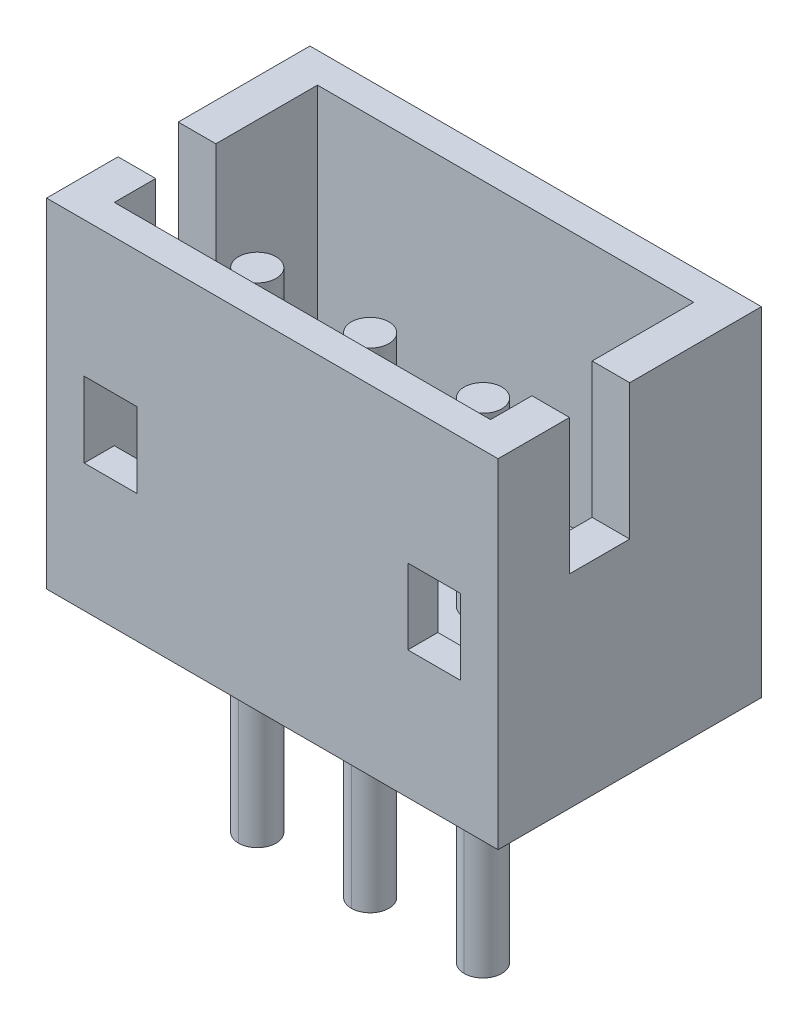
ISO-10303-21;
HEADER;
FILE_DESCRIPTION(('STEP AP214'),'2;1');
FILE_NAME('part.step','',(''),(''),'','','');
FILE_SCHEMA(('AUTOMOTIVE_DESIGN { 1 0 10303 214 1 1 1 1 }'));
ENDSEC;
DATA;
#1=APPLICATION_CONTEXT('core data for automotive mechanical design processes');
#2=APPLICATION_PROTOCOL_DEFINITION('international standard','automotive_design',2000,#1);
#3=PRODUCT_CONTEXT('',#1,'mechanical');
#4=PRODUCT('Part','Part','',(#3));
#5=PRODUCT_RELATED_PRODUCT_CATEGORY('part','',(#4));
#6=PRODUCT_DEFINITION_FORMATION('','',#4);
#7=PRODUCT_DEFINITION_CONTEXT('part definition',#1,'design');
#8=PRODUCT_DEFINITION('design','',#6,#7);
#9=PRODUCT_DEFINITION_SHAPE('','',#8);
#10=(LENGTH_UNIT() NAMED_UNIT(*) SI_UNIT(.MILLI.,.METRE.));
#11=(NAMED_UNIT(*) PLANE_ANGLE_UNIT() SI_UNIT($,.RADIAN.));
#12=(NAMED_UNIT(*) SI_UNIT($,.STERADIAN.) SOLID_ANGLE_UNIT());
#13=UNCERTAINTY_MEASURE_WITH_UNIT(LENGTH_MEASURE(1.E-05),#10,'distance_accuracy_value','');
#14=(GEOMETRIC_REPRESENTATION_CONTEXT(3) GLOBAL_UNCERTAINTY_ASSIGNED_CONTEXT((#13)) GLOBAL_UNIT_ASSIGNED_CONTEXT((#10,
#11,#12)) REPRESENTATION_CONTEXT('',''));
#15=CARTESIAN_POINT('',(0.,0.,0.));
#16=DIRECTION('',(0.,0.,1.));
#17=DIRECTION('',(1.,0.,0.));
#18=AXIS2_PLACEMENT_3D('',#15,#16,#17);
#19=CARTESIAN_POINT('',(1.5,3.8,-1.3));
#20=DIRECTION('',(0.,1.,0.));
#21=DIRECTION('',(1.,0.,0.));
#22=AXIS2_PLACEMENT_3D('',#19,#20,#21);
#23=PLANE('',#22);
#24=CARTESIAN_POINT('',(1.5,3.8,-1.3));
#25=DIRECTION('',(0.,1.,0.));
#26=DIRECTION('',(0.,0.,1.));
#27=AXIS2_PLACEMENT_3D('',#24,#25,#26);
#28=CIRCLE('',#27,0.25);
#29=CARTESIAN_POINT('',(1.5,3.8,-1.05));
#30=VERTEX_POINT('',#29);
#31=CARTESIAN_POINT('',(1.5,3.8,-1.55));
#32=VERTEX_POINT('',#31);
#33=EDGE_CURVE('E28',#30,#32,#28,.T.);
#34=ORIENTED_EDGE('',*,*,#33,.T.);
#35=CARTESIAN_POINT('',(1.5,3.8,-1.3));
#36=DIRECTION('',(0.,1.,0.));
#37=DIRECTION('',(0.,0.,1.));
#38=AXIS2_PLACEMENT_3D('',#35,#36,#37);
#39=CIRCLE('',#38,0.25);
#40=EDGE_CURVE('E290',#32,#30,#39,.T.);
#41=ORIENTED_EDGE('',*,*,#40,.T.);
#42=EDGE_LOOP('',(#34,#41));
#43=FACE_BOUND('',#42,.T.);
#44=ADVANCED_FACE('F18',(#43),#23,.T.);
#45=CARTESIAN_POINT('',(0.,3.8,-1.3));
#46=DIRECTION('',(0.,1.,0.));
#47=DIRECTION('',(1.,0.,0.));
#48=AXIS2_PLACEMENT_3D('',#45,#46,#47);
#49=PLANE('',#48);
#50=CARTESIAN_POINT('',(0.,3.8,-1.3));
#51=DIRECTION('',(0.,1.,0.));
#52=DIRECTION('',(0.,0.,1.));
#53=AXIS2_PLACEMENT_3D('',#50,#51,#52);
#54=CIRCLE('',#53,0.25);
#55=CARTESIAN_POINT('',(0.,3.8,-1.05));
#56=VERTEX_POINT('',#55);
#57=CARTESIAN_POINT('',(0.,3.8,-1.55));
#58=VERTEX_POINT('',#57);
#59=EDGE_CURVE('E211',#56,#58,#54,.T.);
#60=ORIENTED_EDGE('',*,*,#59,.T.);
#61=CARTESIAN_POINT('',(0.,3.8,-1.3));
#62=DIRECTION('',(0.,1.,0.));
#63=DIRECTION('',(0.,0.,1.));
#64=AXIS2_PLACEMENT_3D('',#61,#62,#63);
#65=CIRCLE('',#64,0.25);
#66=EDGE_CURVE('E223',#58,#56,#65,.T.);
#67=ORIENTED_EDGE('',*,*,#66,.T.);
#68=EDGE_LOOP('',(#60,#67));
#69=FACE_BOUND('',#68,.T.);
#70=ADVANCED_FACE('F225',(#69),#49,.T.);
#71=CARTESIAN_POINT('',(-1.5,3.8,-1.3));
#72=DIRECTION('',(0.,1.,0.));
#73=DIRECTION('',(1.,0.,0.));
#74=AXIS2_PLACEMENT_3D('',#71,#72,#73);
#75=PLANE('',#74);
#76=CARTESIAN_POINT('',(-1.5,3.8,-1.3));
#77=DIRECTION('',(0.,1.,0.));
#78=DIRECTION('',(0.,0.,1.));
#79=AXIS2_PLACEMENT_3D('',#76,#77,#78);
#80=CIRCLE('',#79,0.25);
#81=CARTESIAN_POINT('',(-1.5,3.8,-1.05));
#82=VERTEX_POINT('',#81);
#83=CARTESIAN_POINT('',(-1.5,3.8,-1.55));
#84=VERTEX_POINT('',#83);
#85=EDGE_CURVE('E11',#82,#84,#80,.T.);
#86=ORIENTED_EDGE('',*,*,#85,.T.);
#87=CARTESIAN_POINT('',(-1.5,3.8,-1.3));
#88=DIRECTION('',(0.,1.,0.));
#89=DIRECTION('',(0.,0.,1.));
#90=AXIS2_PLACEMENT_3D('',#87,#88,#89);
#91=CIRCLE('',#90,0.25);
#92=EDGE_CURVE('E238',#84,#82,#91,.T.);
#93=ORIENTED_EDGE('',*,*,#92,.T.);
#94=EDGE_LOOP('',(#86,#93));
#95=FACE_BOUND('',#94,.T.);
#96=ADVANCED_FACE('F878',(#95),#75,.T.);
#97=CARTESIAN_POINT('',(-1.5,-2.7,-1.3));
#98=DIRECTION('',(0.,1.,0.));
#99=DIRECTION('',(0.,0.,1.));
#100=AXIS2_PLACEMENT_3D('',#97,#98,#99);
#101=CYLINDRICAL_SURFACE('',#100,0.25);
#102=CARTESIAN_POINT('',(-1.5,1.4,-1.3));
#103=DIRECTION('',(0.,1.,0.));
#104=DIRECTION('',(0.,0.,1.));
#105=AXIS2_PLACEMENT_3D('',#102,#103,#104);
#106=CIRCLE('',#105,0.25);
#107=CARTESIAN_POINT('',(-1.5,1.4,-1.05));
#108=VERTEX_POINT('',#107);
#109=CARTESIAN_POINT('',(-1.5,1.4,-1.55));
#110=VERTEX_POINT('',#109);
#111=EDGE_CURVE('E264',#108,#110,#106,.T.);
#112=ORIENTED_EDGE('',*,*,#111,.T.);
#113=DIRECTION('',(0.,1.,0.));
#114=VECTOR('',#113,1.);
#115=CARTESIAN_POINT('',(-1.5,-2.7,-1.55));
#116=LINE('',#115,#114);
#117=EDGE_CURVE('E251',#110,#84,#116,.T.);
#118=ORIENTED_EDGE('',*,*,#117,.T.);
#119=ORIENTED_EDGE('',*,*,#85,.F.);
#120=DIRECTION('',(0.,1.,0.));
#121=VECTOR('',#120,1.);
#122=CARTESIAN_POINT('',(-1.5,-2.7,-1.05));
#123=LINE('',#122,#121);
#124=EDGE_CURVE('E432',#108,#82,#123,.T.);
#125=ORIENTED_EDGE('',*,*,#124,.F.);
#126=EDGE_LOOP('',(#112,#118,#119,#125));
#127=FACE_BOUND('',#126,.T.);
#128=ADVANCED_FACE('F883',(#127),#101,.T.);
#129=CARTESIAN_POINT('',(1.5,-2.7,-1.3));
#130=DIRECTION('',(0.,1.,0.));
#131=DIRECTION('',(0.,0.,1.));
#132=AXIS2_PLACEMENT_3D('',#129,#130,#131);
#133=CYLINDRICAL_SURFACE('',#132,0.25);
#134=CARTESIAN_POINT('',(1.5,1.4,-1.3));
#135=DIRECTION('',(0.,1.,0.));
#136=DIRECTION('',(0.,0.,1.));
#137=AXIS2_PLACEMENT_3D('',#134,#135,#136);
#138=CIRCLE('',#137,0.25);
#139=CARTESIAN_POINT('',(1.5,1.4,-1.05));
#140=VERTEX_POINT('',#139);
#141=CARTESIAN_POINT('',(1.5,1.4,-1.55));
#142=VERTEX_POINT('',#141);
#143=EDGE_CURVE('E242',#140,#142,#138,.T.);
#144=ORIENTED_EDGE('',*,*,#143,.T.);
#145=DIRECTION('',(0.,1.,0.));
#146=VECTOR('',#145,1.);
#147=CARTESIAN_POINT('',(1.5,-2.7,-1.55));
#148=LINE('',#147,#146);
#149=EDGE_CURVE('E222',#142,#32,#148,.T.);
#150=ORIENTED_EDGE('',*,*,#149,.T.);
#151=ORIENTED_EDGE('',*,*,#33,.F.);
#152=DIRECTION('',(0.,1.,0.));
#153=VECTOR('',#152,1.);
#154=CARTESIAN_POINT('',(1.5,-2.7,-1.05));
#155=LINE('',#154,#153);
#156=EDGE_CURVE('E21',#140,#30,#155,.T.);
#157=ORIENTED_EDGE('',*,*,#156,.F.);
#158=EDGE_LOOP('',(#144,#150,#151,#157));
#159=FACE_BOUND('',#158,.T.);
#160=ADVANCED_FACE('F892',(#159),#133,.T.);
#161=CARTESIAN_POINT('',(1.5,-2.7,-1.3));
#162=DIRECTION('',(0.,1.,0.));
#163=DIRECTION('',(0.,0.,1.));
#164=AXIS2_PLACEMENT_3D('',#161,#162,#163);
#165=CYLINDRICAL_SURFACE('',#164,0.25);
#166=ORIENTED_EDGE('',*,*,#149,.F.);
#167=CARTESIAN_POINT('',(1.5,1.4,-1.3));
#168=DIRECTION('',(0.,1.,0.));
#169=DIRECTION('',(0.,0.,1.));
#170=AXIS2_PLACEMENT_3D('',#167,#168,#169);
#171=CIRCLE('',#170,0.25);
#172=EDGE_CURVE('E245',#142,#140,#171,.T.);
#173=ORIENTED_EDGE('',*,*,#172,.T.);
#174=ORIENTED_EDGE('',*,*,#156,.T.);
#175=ORIENTED_EDGE('',*,*,#40,.F.);
#176=EDGE_LOOP('',(#166,#173,#174,#175));
#177=FACE_BOUND('',#176,.T.);
#178=ADVANCED_FACE('F897',(#177),#165,.T.);
#179=CARTESIAN_POINT('',(0.,-2.7,-1.3));
#180=DIRECTION('',(0.,1.,0.));
#181=DIRECTION('',(0.,0.,1.));
#182=AXIS2_PLACEMENT_3D('',#179,#180,#181);
#183=CYLINDRICAL_SURFACE('',#182,0.25);
#184=CARTESIAN_POINT('',(0.,1.4,-1.3));
#185=DIRECTION('',(0.,1.,0.));
#186=DIRECTION('',(0.,0.,1.));
#187=AXIS2_PLACEMENT_3D('',#184,#185,#186);
#188=CIRCLE('',#187,0.25);
#189=CARTESIAN_POINT('',(0.,1.4,-1.05));
#190=VERTEX_POINT('',#189);
#191=CARTESIAN_POINT('',(0.,1.4,-1.55));
#192=VERTEX_POINT('',#191);
#193=EDGE_CURVE('E241',#190,#192,#188,.T.);
#194=ORIENTED_EDGE('',*,*,#193,.T.);
#195=DIRECTION('',(0.,1.,0.));
#196=VECTOR('',#195,1.);
#197=CARTESIAN_POINT('',(0.,-2.7,-1.55));
#198=LINE('',#197,#196);
#199=EDGE_CURVE('E218',#192,#58,#198,.T.);
#200=ORIENTED_EDGE('',*,*,#199,.T.);
#201=ORIENTED_EDGE('',*,*,#59,.F.);
#202=DIRECTION('',(0.,1.,0.));
#203=VECTOR('',#202,1.);
#204=CARTESIAN_POINT('',(0.,-2.7,-1.05));
#205=LINE('',#204,#203);
#206=EDGE_CURVE('E216',#190,#56,#205,.T.);
#207=ORIENTED_EDGE('',*,*,#206,.F.);
#208=EDGE_LOOP('',(#194,#200,#201,#207));
#209=FACE_BOUND('',#208,.T.);
#210=ADVANCED_FACE('F214',(#209),#183,.T.);
#211=CARTESIAN_POINT('',(0.,-2.7,-1.3));
#212=DIRECTION('',(0.,1.,0.));
#213=DIRECTION('',(0.,0.,1.));
#214=AXIS2_PLACEMENT_3D('',#211,#212,#213);
#215=CYLINDRICAL_SURFACE('',#214,0.25);
#216=ORIENTED_EDGE('',*,*,#199,.F.);
#217=CARTESIAN_POINT('',(0.,1.4,-1.3));
#218=DIRECTION('',(0.,1.,0.));
#219=DIRECTION('',(0.,0.,1.));
#220=AXIS2_PLACEMENT_3D('',#217,#218,#219);
#221=CIRCLE('',#220,0.25);
#222=EDGE_CURVE('E231',#192,#190,#221,.T.);
#223=ORIENTED_EDGE('',*,*,#222,.T.);
#224=ORIENTED_EDGE('',*,*,#206,.T.);
#225=ORIENTED_EDGE('',*,*,#66,.F.);
#226=EDGE_LOOP('',(#216,#223,#224,#225));
#227=FACE_BOUND('',#226,.T.);
#228=ADVANCED_FACE('F229',(#227),#215,.T.);
#229=CARTESIAN_POINT('',(-1.5,-2.7,-1.3));
#230=DIRECTION('',(0.,1.,0.));
#231=DIRECTION('',(0.,0.,1.));
#232=AXIS2_PLACEMENT_3D('',#229,#230,#231);
#233=CYLINDRICAL_SURFACE('',#232,0.25);
#234=ORIENTED_EDGE('',*,*,#117,.F.);
#235=CARTESIAN_POINT('',(-1.5,1.4,-1.3));
#236=DIRECTION('',(0.,1.,0.));
#237=DIRECTION('',(0.,0.,1.));
#238=AXIS2_PLACEMENT_3D('',#235,#236,#237);
#239=CIRCLE('',#238,0.25);
#240=EDGE_CURVE('E256',#110,#108,#239,.T.);
#241=ORIENTED_EDGE('',*,*,#240,.T.);
#242=ORIENTED_EDGE('',*,*,#124,.T.);
#243=ORIENTED_EDGE('',*,*,#92,.F.);
#244=EDGE_LOOP('',(#234,#241,#242,#243));
#245=FACE_BOUND('',#244,.T.);
#246=ADVANCED_FACE('F942',(#245),#233,.T.);
#247=CARTESIAN_POINT('',(2.5,1.1,-2.05));
#248=DIRECTION('',(0.,0.707106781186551,-0.707106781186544));
#249=DIRECTION('',(-1.,0.,0.));
#250=AXIS2_PLACEMENT_3D('',#247,#248,#249);
#251=PLANE('',#250);
#252=DIRECTION('',(0.,-0.707106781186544,-0.707106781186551));
#253=VECTOR('',#252,1.);
#254=CARTESIAN_POINT('',(-2.5,1.1,-2.05));
#255=LINE('',#254,#253);
#256=CARTESIAN_POINT('',(-2.5,1.4,-1.75));
#257=VERTEX_POINT('',#256);
#258=CARTESIAN_POINT('',(-2.5,1.1,-2.05));
#259=VERTEX_POINT('',#258);
#260=EDGE_CURVE('E397',#257,#259,#255,.T.);
#261=ORIENTED_EDGE('',*,*,#260,.F.);
#262=DIRECTION('',(-1.,0.,0.));
#263=VECTOR('',#262,1.);
#264=CARTESIAN_POINT('',(2.5,1.4,-1.75));
#265=LINE('',#264,#263);
#266=CARTESIAN_POINT('',(2.5,1.4,-1.75));
#267=VERTEX_POINT('',#266);
#268=EDGE_CURVE('E285',#267,#257,#265,.T.);
#269=ORIENTED_EDGE('',*,*,#268,.F.);
#270=DIRECTION('',(0.,-0.707106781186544,-0.707106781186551));
#271=VECTOR('',#270,1.);
#272=CARTESIAN_POINT('',(2.5,1.1,-2.05));
#273=LINE('',#272,#271);
#274=CARTESIAN_POINT('',(2.5,1.1,-2.05));
#275=VERTEX_POINT('',#274);
#276=EDGE_CURVE('E410',#267,#275,#273,.T.);
#277=ORIENTED_EDGE('',*,*,#276,.T.);
#278=DIRECTION('',(-1.,0.,0.));
#279=VECTOR('',#278,1.);
#280=CARTESIAN_POINT('',(2.5,1.1,-2.05));
#281=LINE('',#280,#279);
#282=EDGE_CURVE('E322',#275,#259,#281,.T.);
#283=ORIENTED_EDGE('',*,*,#282,.T.);
#284=EDGE_LOOP('',(#261,#269,#277,#283));
#285=FACE_BOUND('',#284,.T.);
#286=ADVANCED_FACE('F449',(#285),#251,.T.);
#287=CARTESIAN_POINT('',(-2.5,1.4,-0.4));
#288=DIRECTION('',(0.,1.,0.));
#289=DIRECTION('',(1.,0.,0.));
#290=AXIS2_PLACEMENT_3D('',#287,#288,#289);
#291=PLANE('',#290);
#292=ORIENTED_EDGE('',*,*,#143,.F.);
#293=ORIENTED_EDGE('',*,*,#172,.F.);
#294=EDGE_LOOP('',(#292,#293));
#295=FACE_BOUND('',#294,.T.);
#296=ORIENTED_EDGE('',*,*,#193,.F.);
#297=ORIENTED_EDGE('',*,*,#222,.F.);
#298=EDGE_LOOP('',(#296,#297));
#299=FACE_BOUND('',#298,.T.);
#300=ORIENTED_EDGE('',*,*,#111,.F.);
#301=ORIENTED_EDGE('',*,*,#240,.F.);
#302=EDGE_LOOP('',(#300,#301));
#303=FACE_BOUND('',#302,.T.);
#304=DIRECTION('',(0.,0.,-1.));
#305=VECTOR('',#304,1.);
#306=CARTESIAN_POINT('',(2.5,1.4,-3.1));
#307=LINE('',#306,#305);
#308=CARTESIAN_POINT('',(2.5,1.4,-0.4));
#309=VERTEX_POINT('',#308);
#310=EDGE_CURVE('E347',#309,#267,#307,.T.);
#311=ORIENTED_EDGE('',*,*,#310,.T.);
#312=ORIENTED_EDGE('',*,*,#268,.T.);
#313=DIRECTION('',(0.,0.,1.));
#314=VECTOR('',#313,1.);
#315=CARTESIAN_POINT('',(-2.5,1.4,-3.1));
#316=LINE('',#315,#314);
#317=CARTESIAN_POINT('',(-2.5,1.4,-0.4));
#318=VERTEX_POINT('',#317);
#319=EDGE_CURVE('E393',#257,#318,#316,.T.);
#320=ORIENTED_EDGE('',*,*,#319,.T.);
#321=DIRECTION('',(1.,0.,0.));
#322=VECTOR('',#321,1.);
#323=CARTESIAN_POINT('',(-2.5,1.4,-0.4));
#324=LINE('',#323,#322);
#325=EDGE_CURVE('E325',#318,#309,#324,.T.);
#326=ORIENTED_EDGE('',*,*,#325,.T.);
#327=EDGE_LOOP('',(#311,#312,#320,#326));
#328=FACE_BOUND('',#327,.T.);
#329=ADVANCED_FACE('F442',(#295,#299,#303,#328),#291,.T.);
#330=CARTESIAN_POINT('',(2.5,1.1,-3.1));
#331=DIRECTION('',(0.,1.,0.));
#332=DIRECTION('',(0.,0.,-1.));
#333=AXIS2_PLACEMENT_3D('',#330,#331,#332);
#334=PLANE('',#333);
#335=DIRECTION('',(0.,0.,-1.));
#336=VECTOR('',#335,1.);
#337=CARTESIAN_POINT('',(-2.5,1.1,-3.1));
#338=LINE('',#337,#336);
#339=CARTESIAN_POINT('',(-2.5,1.1,-3.1));
#340=VERTEX_POINT('',#339);
#341=EDGE_CURVE('E424',#259,#340,#338,.T.);
#342=ORIENTED_EDGE('',*,*,#341,.F.);
#343=ORIENTED_EDGE('',*,*,#282,.F.);
#344=DIRECTION('',(0.,0.,-1.));
#345=VECTOR('',#344,1.);
#346=CARTESIAN_POINT('',(2.5,1.1,-3.1));
#347=LINE('',#346,#345);
#348=CARTESIAN_POINT('',(2.5,1.1,-3.1));
#349=VERTEX_POINT('',#348);
#350=EDGE_CURVE('E406',#275,#349,#347,.T.);
#351=ORIENTED_EDGE('',*,*,#350,.T.);
#352=DIRECTION('',(-1.,0.,0.));
#353=VECTOR('',#352,1.);
#354=CARTESIAN_POINT('',(2.5,1.1,-3.1));
#355=LINE('',#354,#353);
#356=EDGE_CURVE('E433',#349,#340,#355,.T.);
#357=ORIENTED_EDGE('',*,*,#356,.T.);
#358=EDGE_LOOP('',(#342,#343,#351,#357));
#359=FACE_BOUND('',#358,.T.);
#360=ADVANCED_FACE('F470',(#359),#334,.T.);
#361=CARTESIAN_POINT('',(-2.5,1.4,-0.4));
#362=DIRECTION('',(0.,0.,1.));
#363=DIRECTION('',(1.,0.,0.));
#364=AXIS2_PLACEMENT_3D('',#361,#362,#363);
#365=PLANE('',#364);
#366=DIRECTION('',(0.,1.,0.));
#367=VECTOR('',#366,1.);
#368=CARTESIAN_POINT('',(2.5,1.4,-0.4));
#369=LINE('',#368,#367);
#370=CARTESIAN_POINT('',(2.5,2.7,-0.4));
#371=VERTEX_POINT('',#370);
#372=CARTESIAN_POINT('',(2.5,4.5,-0.4));
#373=VERTEX_POINT('',#372);
#374=EDGE_CURVE('E269',#371,#373,#369,.T.);
#375=ORIENTED_EDGE('',*,*,#374,.F.);
#376=DIRECTION('',(1.,0.,0.));
#377=VECTOR('',#376,1.);
#378=CARTESIAN_POINT('',(2.5,2.7,-0.4));
#379=LINE('',#378,#377);
#380=CARTESIAN_POINT('',(1.8,2.7,-0.4));
#381=VERTEX_POINT('',#380);
#382=EDGE_CURVE('E387',#381,#371,#379,.T.);
#383=ORIENTED_EDGE('',*,*,#382,.F.);
#384=DIRECTION('',(0.,1.,0.));
#385=VECTOR('',#384,1.);
#386=CARTESIAN_POINT('',(1.8,2.7,-0.4));
#387=LINE('',#386,#385);
#388=CARTESIAN_POINT('',(1.8,1.7,-0.4));
#389=VERTEX_POINT('',#388);
#390=EDGE_CURVE('E297',#389,#381,#387,.T.);
#391=ORIENTED_EDGE('',*,*,#390,.F.);
#392=DIRECTION('',(-1.,0.,0.));
#393=VECTOR('',#392,1.);
#394=CARTESIAN_POINT('',(2.5,1.7,-0.4));
#395=LINE('',#394,#393);
#396=CARTESIAN_POINT('',(2.5,1.7,-0.4));
#397=VERTEX_POINT('',#396);
#398=EDGE_CURVE('E358',#397,#389,#395,.T.);
#399=ORIENTED_EDGE('',*,*,#398,.F.);
#400=DIRECTION('',(0.,1.,0.));
#401=VECTOR('',#400,1.);
#402=CARTESIAN_POINT('',(2.5,1.4,-0.4));
#403=LINE('',#402,#401);
#404=EDGE_CURVE('E270',#309,#397,#403,.T.);
#405=ORIENTED_EDGE('',*,*,#404,.F.);
#406=ORIENTED_EDGE('',*,*,#325,.F.);
#407=DIRECTION('',(0.,1.,0.));
#408=VECTOR('',#407,1.);
#409=CARTESIAN_POINT('',(-2.5,1.4,-0.4));
#410=LINE('',#409,#408);
#411=CARTESIAN_POINT('',(-2.5,1.7,-0.4));
#412=VERTEX_POINT('',#411);
#413=EDGE_CURVE('E373',#318,#412,#410,.T.);
#414=ORIENTED_EDGE('',*,*,#413,.T.);
#415=DIRECTION('',(-1.,0.,0.));
#416=VECTOR('',#415,1.);
#417=CARTESIAN_POINT('',(-2.5,1.7,-0.4));
#418=LINE('',#417,#416);
#419=CARTESIAN_POINT('',(-1.8,1.7,-0.4));
#420=VERTEX_POINT('',#419);
#421=EDGE_CURVE('E276',#420,#412,#418,.T.);
#422=ORIENTED_EDGE('',*,*,#421,.F.);
#423=DIRECTION('',(0.,-1.,0.));
#424=VECTOR('',#423,1.);
#425=CARTESIAN_POINT('',(-1.8,2.7,-0.4));
#426=LINE('',#425,#424);
#427=CARTESIAN_POINT('',(-1.8,2.7,-0.4));
#428=VERTEX_POINT('',#427);
#429=EDGE_CURVE('E386',#428,#420,#426,.T.);
#430=ORIENTED_EDGE('',*,*,#429,.F.);
#431=DIRECTION('',(1.,0.,0.));
#432=VECTOR('',#431,1.);
#433=CARTESIAN_POINT('',(-2.5,2.7,-0.4));
#434=LINE('',#433,#432);
#435=CARTESIAN_POINT('',(-2.5,2.7,-0.4));
#436=VERTEX_POINT('',#435);
#437=EDGE_CURVE('E368',#436,#428,#434,.T.);
#438=ORIENTED_EDGE('',*,*,#437,.F.);
#439=DIRECTION('',(0.,1.,0.));
#440=VECTOR('',#439,1.);
#441=CARTESIAN_POINT('',(-2.5,1.4,-0.4));
#442=LINE('',#441,#440);
#443=CARTESIAN_POINT('',(-2.5,4.5,-0.4));
#444=VERTEX_POINT('',#443);
#445=EDGE_CURVE('E370',#436,#444,#442,.T.);
#446=ORIENTED_EDGE('',*,*,#445,.T.);
#447=DIRECTION('',(1.,0.,0.));
#448=VECTOR('',#447,1.);
#449=CARTESIAN_POINT('',(-2.5,4.5,-0.4));
#450=LINE('',#449,#448);
#451=EDGE_CURVE('E348',#444,#373,#450,.T.);
#452=ORIENTED_EDGE('',*,*,#451,.T.);
#453=EDGE_LOOP('',(#375,#383,#391,#399,#405,#406,#414,#422,#430,#438,#446,#452));
#454=FACE_BOUND('',#453,.T.);
#455=ADVANCED_FACE('F460',(#454),#365,.F.);
#456=CARTESIAN_POINT('',(-2.5,1.4,-3.1));
#457=DIRECTION('',(0.,0.,-1.));
#458=DIRECTION('',(-1.,0.,0.));
#459=AXIS2_PLACEMENT_3D('',#456,#457,#458);
#460=PLANE('',#459);
#461=DIRECTION('',(-1.,0.,0.));
#462=VECTOR('',#461,1.);
#463=CARTESIAN_POINT('',(-2.5,4.5,-3.1));
#464=LINE('',#463,#462);
#465=CARTESIAN_POINT('',(2.5,4.5,-3.1));
#466=VERTEX_POINT('',#465);
#467=CARTESIAN_POINT('',(-2.5,4.5,-3.1));
#468=VERTEX_POINT('',#467);
#469=EDGE_CURVE('E299',#466,#468,#464,.T.);
#470=ORIENTED_EDGE('',*,*,#469,.T.);
#471=DIRECTION('',(0.,1.,0.));
#472=VECTOR('',#471,1.);
#473=CARTESIAN_POINT('',(-2.5,1.4,-3.1));
#474=LINE('',#473,#472);
#475=EDGE_CURVE('E298',#340,#468,#474,.T.);
#476=ORIENTED_EDGE('',*,*,#475,.F.);
#477=ORIENTED_EDGE('',*,*,#356,.F.);
#478=DIRECTION('',(0.,1.,0.));
#479=VECTOR('',#478,1.);
#480=CARTESIAN_POINT('',(2.5,1.4,-3.1));
#481=LINE('',#480,#479);
#482=EDGE_CURVE('E275',#349,#466,#481,.T.);
#483=ORIENTED_EDGE('',*,*,#482,.T.);
#484=EDGE_LOOP('',(#470,#476,#477,#483));
#485=FACE_BOUND('',#484,.T.);
#486=ADVANCED_FACE('F997',(#485),#460,.F.);
#487=CARTESIAN_POINT('',(1.5,-2.7,-1.3));
#488=DIRECTION('',(0.,1.,0.));
#489=DIRECTION('',(1.,0.,0.));
#490=AXIS2_PLACEMENT_3D('',#487,#488,#489);
#491=PLANE('',#490);
#492=CARTESIAN_POINT('',(1.5,-2.7,-1.3));
#493=DIRECTION('',(0.,1.,0.));
#494=DIRECTION('',(0.,0.,1.));
#495=AXIS2_PLACEMENT_3D('',#492,#493,#494);
#496=CIRCLE('',#495,0.25);
#497=CARTESIAN_POINT('',(1.5,-2.7,-1.05));
#498=VERTEX_POINT('',#497);
#499=CARTESIAN_POINT('',(1.5,-2.7,-1.55));
#500=VERTEX_POINT('',#499);
#501=EDGE_CURVE('E571',#498,#500,#496,.T.);
#502=ORIENTED_EDGE('',*,*,#501,.F.);
#503=CARTESIAN_POINT('',(1.5,-2.7,-1.3));
#504=DIRECTION('',(0.,1.,0.));
#505=DIRECTION('',(0.,0.,1.));
#506=AXIS2_PLACEMENT_3D('',#503,#504,#505);
#507=CIRCLE('',#506,0.25);
#508=EDGE_CURVE('E289',#500,#498,#507,.T.);
#509=ORIENTED_EDGE('',*,*,#508,.F.);
#510=EDGE_LOOP('',(#502,#509));
#511=FACE_BOUND('',#510,.T.);
#512=ADVANCED_FACE('F1008',(#511),#491,.F.);
#513=CARTESIAN_POINT('',(-3.,4.5,-0.95));
#514=DIRECTION('',(0.,0.,1.));
#515=DIRECTION('',(0.,-1.,0.));
#516=AXIS2_PLACEMENT_3D('',#513,#514,#515);
#517=PLANE('',#516);
#518=DIRECTION('',(1.,0.,0.));
#519=VECTOR('',#518,1.);
#520=CARTESIAN_POINT('',(-3.,2.7,-0.95));
#521=LINE('',#520,#519);
#522=CARTESIAN_POINT('',(-3.,2.7,-0.95));
#523=VERTEX_POINT('',#522);
#524=CARTESIAN_POINT('',(-2.5,2.7,-0.95));
#525=VERTEX_POINT('',#524);
#526=EDGE_CURVE('E428',#523,#525,#521,.T.);
#527=ORIENTED_EDGE('',*,*,#526,.F.);
#528=DIRECTION('',(0.,-1.,0.));
#529=VECTOR('',#528,1.);
#530=CARTESIAN_POINT('',(-3.,4.5,-0.95));
#531=LINE('',#530,#529);
#532=CARTESIAN_POINT('',(-3.,4.5,-0.95));
#533=VERTEX_POINT('',#532);
#534=EDGE_CURVE('E641',#533,#523,#531,.T.);
#535=ORIENTED_EDGE('',*,*,#534,.F.);
#536=DIRECTION('',(1.,0.,0.));
#537=VECTOR('',#536,1.);
#538=CARTESIAN_POINT('',(-3.,4.5,-0.95));
#539=LINE('',#538,#537);
#540=CARTESIAN_POINT('',(-2.5,4.5,-0.95));
#541=VERTEX_POINT('',#540);
#542=EDGE_CURVE('E362',#533,#541,#539,.T.);
#543=ORIENTED_EDGE('',*,*,#542,.T.);
#544=DIRECTION('',(0.,1.,0.));
#545=VECTOR('',#544,1.);
#546=CARTESIAN_POINT('',(-2.5,1.4,-0.95));
#547=LINE('',#546,#545);
#548=EDGE_CURVE('E374',#525,#541,#547,.T.);
#549=ORIENTED_EDGE('',*,*,#548,.F.);
#550=EDGE_LOOP('',(#527,#535,#543,#549));
#551=FACE_BOUND('',#550,.T.);
#552=ADVANCED_FACE('F808',(#551),#517,.F.);
#553=CARTESIAN_POINT('',(-3.,4.5,-1.75));
#554=DIRECTION('',(0.,0.,-1.));
#555=DIRECTION('',(-1.,0.,0.));
#556=AXIS2_PLACEMENT_3D('',#553,#554,#555);
#557=PLANE('',#556);
#558=DIRECTION('',(1.,0.,0.));
#559=VECTOR('',#558,1.);
#560=CARTESIAN_POINT('',(-3.,4.5,-1.75));
#561=LINE('',#560,#559);
#562=CARTESIAN_POINT('',(-3.,4.5,-1.75));
#563=VERTEX_POINT('',#562);
#564=CARTESIAN_POINT('',(-2.5,4.5,-1.75));
#565=VERTEX_POINT('',#564);
#566=EDGE_CURVE('E330',#563,#565,#561,.T.);
#567=ORIENTED_EDGE('',*,*,#566,.F.);
#568=DIRECTION('',(0.,1.,0.));
#569=VECTOR('',#568,1.);
#570=CARTESIAN_POINT('',(-3.,4.5,-1.75));
#571=LINE('',#570,#569);
#572=CARTESIAN_POINT('',(-3.,2.7,-1.75));
#573=VERTEX_POINT('',#572);
#574=EDGE_CURVE('E523',#573,#563,#571,.T.);
#575=ORIENTED_EDGE('',*,*,#574,.F.);
#576=DIRECTION('',(1.,0.,0.));
#577=VECTOR('',#576,1.);
#578=CARTESIAN_POINT('',(-3.,2.7,-1.75));
#579=LINE('',#578,#577);
#580=CARTESIAN_POINT('',(-2.5,2.7,-1.75));
#581=VERTEX_POINT('',#580);
#582=EDGE_CURVE('E425',#573,#581,#579,.T.);
#583=ORIENTED_EDGE('',*,*,#582,.T.);
#584=DIRECTION('',(0.,-1.,0.));
#585=VECTOR('',#584,1.);
#586=CARTESIAN_POINT('',(-2.5,1.4,-1.75));
#587=LINE('',#586,#585);
#588=EDGE_CURVE('E293',#565,#581,#587,.T.);
#589=ORIENTED_EDGE('',*,*,#588,.F.);
#590=EDGE_LOOP('',(#567,#575,#583,#589));
#591=FACE_BOUND('',#590,.T.);
#592=ADVANCED_FACE('F821',(#591),#557,.F.);
#593=CARTESIAN_POINT('',(-3.,2.7,-0.95));
#594=DIRECTION('',(0.,-1.,0.));
#595=DIRECTION('',(0.,0.,-1.));
#596=AXIS2_PLACEMENT_3D('',#593,#594,#595);
#597=PLANE('',#596);
#598=ORIENTED_EDGE('',*,*,#582,.F.);
#599=DIRECTION('',(0.,0.,-1.));
#600=VECTOR('',#599,1.);
#601=CARTESIAN_POINT('',(-3.,2.7,-0.95));
#602=LINE('',#601,#600);
#603=EDGE_CURVE('E528',#523,#573,#602,.T.);
#604=ORIENTED_EDGE('',*,*,#603,.F.);
#605=ORIENTED_EDGE('',*,*,#526,.T.);
#606=DIRECTION('',(0.,0.,1.));
#607=VECTOR('',#606,1.);
#608=CARTESIAN_POINT('',(-2.5,2.7,-3.1));
#609=LINE('',#608,#607);
#610=EDGE_CURVE('E357',#581,#525,#609,.T.);
#611=ORIENTED_EDGE('',*,*,#610,.F.);
#612=EDGE_LOOP('',(#598,#604,#605,#611));
#613=FACE_BOUND('',#612,.T.);
#614=ADVANCED_FACE('F814',(#613),#597,.F.);
#615=CARTESIAN_POINT('',(1.8,2.7,-3.501));
#616=DIRECTION('',(-1.,0.,0.));
#617=DIRECTION('',(0.,0.,1.));
#618=AXIS2_PLACEMENT_3D('',#615,#616,#617);
#619=PLANE('',#618);
#620=ORIENTED_EDGE('',*,*,#390,.T.);
#621=DIRECTION('',(0.,0.,1.));
#622=VECTOR('',#621,1.);
#623=CARTESIAN_POINT('',(1.8,2.7,-3.501));
#624=LINE('',#623,#622);
#625=CARTESIAN_POINT('',(1.8,2.7,0.));
#626=VERTEX_POINT('',#625);
#627=EDGE_CURVE('E401',#381,#626,#624,.T.);
#628=ORIENTED_EDGE('',*,*,#627,.T.);
#629=DIRECTION('',(0.,-1.,0.));
#630=VECTOR('',#629,1.);
#631=CARTESIAN_POINT('',(1.8,2.7,0.));
#632=LINE('',#631,#630);
#633=CARTESIAN_POINT('',(1.8,1.7,0.));
#634=VERTEX_POINT('',#633);
#635=EDGE_CURVE('E552',#626,#634,#632,.T.);
#636=ORIENTED_EDGE('',*,*,#635,.T.);
#637=DIRECTION('',(0.,0.,1.));
#638=VECTOR('',#637,1.);
#639=CARTESIAN_POINT('',(1.8,1.7,-3.501));
#640=LINE('',#639,#638);
#641=EDGE_CURVE('E353',#389,#634,#640,.T.);
#642=ORIENTED_EDGE('',*,*,#641,.F.);
#643=EDGE_LOOP('',(#620,#628,#636,#642));
#644=FACE_BOUND('',#643,.T.);
#645=ADVANCED_FACE('F1063',(#644),#619,.F.);
#646=CARTESIAN_POINT('',(-2.5,1.4,-3.1));
#647=DIRECTION('',(-1.,0.,0.));
#648=DIRECTION('',(0.,0.,1.));
#649=AXIS2_PLACEMENT_3D('',#646,#647,#648);
#650=PLANE('',#649);
#651=ORIENTED_EDGE('',*,*,#610,.T.);
#652=ORIENTED_EDGE('',*,*,#548,.T.);
#653=DIRECTION('',(0.,0.,1.));
#654=VECTOR('',#653,1.);
#655=CARTESIAN_POINT('',(-2.5,4.5,-3.1));
#656=LINE('',#655,#654);
#657=EDGE_CURVE('E352',#541,#444,#656,.T.);
#658=ORIENTED_EDGE('',*,*,#657,.T.);
#659=ORIENTED_EDGE('',*,*,#445,.F.);
#660=DIRECTION('',(0.,0.,1.));
#661=VECTOR('',#660,1.);
#662=CARTESIAN_POINT('',(-2.5,2.7,-3.501));
#663=LINE('',#662,#661);
#664=CARTESIAN_POINT('',(-2.5,2.7,0.));
#665=VERTEX_POINT('',#664);
#666=EDGE_CURVE('E382',#436,#665,#663,.T.);
#667=ORIENTED_EDGE('',*,*,#666,.T.);
#668=DIRECTION('',(0.,-1.,0.));
#669=VECTOR('',#668,1.);
#670=CARTESIAN_POINT('',(-2.5,2.7,0.));
#671=LINE('',#670,#669);
#672=CARTESIAN_POINT('',(-2.5,1.7,0.));
#673=VERTEX_POINT('',#672);
#674=EDGE_CURVE('E620',#665,#673,#671,.T.);
#675=ORIENTED_EDGE('',*,*,#674,.T.);
#676=DIRECTION('',(0.,0.,1.));
#677=VECTOR('',#676,1.);
#678=CARTESIAN_POINT('',(-2.5,1.7,-3.501));
#679=LINE('',#678,#677);
#680=EDGE_CURVE('E271',#412,#673,#679,.T.);
#681=ORIENTED_EDGE('',*,*,#680,.F.);
#682=ORIENTED_EDGE('',*,*,#413,.F.);
#683=ORIENTED_EDGE('',*,*,#319,.F.);
#684=ORIENTED_EDGE('',*,*,#260,.T.);
#685=ORIENTED_EDGE('',*,*,#341,.T.);
#686=ORIENTED_EDGE('',*,*,#475,.T.);
#687=DIRECTION('',(0.,0.,1.));
#688=VECTOR('',#687,1.);
#689=CARTESIAN_POINT('',(-2.5,4.5,-3.1));
#690=LINE('',#689,#688);
#691=EDGE_CURVE('E304',#468,#565,#690,.T.);
#692=ORIENTED_EDGE('',*,*,#691,.T.);
#693=ORIENTED_EDGE('',*,*,#588,.T.);
#694=EDGE_LOOP('',(#651,#652,#658,#659,#667,#675,#681,#682,#683,#684,#685,#686,#692,#693));
#695=FACE_BOUND('',#694,.T.);
#696=ADVANCED_FACE('F455',(#695),#650,.F.);
#697=CARTESIAN_POINT('',(2.5,1.7,-3.501));
#698=DIRECTION('',(0.,-1.,0.));
#699=DIRECTION('',(0.,0.,-1.));
#700=AXIS2_PLACEMENT_3D('',#697,#698,#699);
#701=PLANE('',#700);
#702=ORIENTED_EDGE('',*,*,#398,.T.);
#703=ORIENTED_EDGE('',*,*,#641,.T.);
#704=DIRECTION('',(1.,0.,0.));
#705=VECTOR('',#704,1.);
#706=CARTESIAN_POINT('',(2.5,1.7,0.));
#707=LINE('',#706,#705);
#708=CARTESIAN_POINT('',(2.5,1.7,0.));
#709=VERTEX_POINT('',#708);
#710=EDGE_CURVE('E594',#634,#709,#707,.T.);
#711=ORIENTED_EDGE('',*,*,#710,.T.);
#712=DIRECTION('',(0.,0.,1.));
#713=VECTOR('',#712,1.);
#714=CARTESIAN_POINT('',(2.5,1.7,-3.501));
#715=LINE('',#714,#713);
#716=EDGE_CURVE('E265',#397,#709,#715,.T.);
#717=ORIENTED_EDGE('',*,*,#716,.F.);
#718=EDGE_LOOP('',(#702,#703,#711,#717));
#719=FACE_BOUND('',#718,.T.);
#720=ADVANCED_FACE('F1075',(#719),#701,.F.);
#721=CARTESIAN_POINT('',(2.5,1.4,-3.1));
#722=DIRECTION('',(1.,0.,0.));
#723=DIRECTION('',(0.,0.,-1.));
#724=AXIS2_PLACEMENT_3D('',#721,#722,#723);
#725=PLANE('',#724);
#726=DIRECTION('',(0.,0.,-1.));
#727=VECTOR('',#726,1.);
#728=CARTESIAN_POINT('',(2.5,4.5,-3.1));
#729=LINE('',#728,#727);
#730=CARTESIAN_POINT('',(2.5,4.5,-0.95));
#731=VERTEX_POINT('',#730);
#732=EDGE_CURVE('E343',#373,#731,#729,.T.);
#733=ORIENTED_EDGE('',*,*,#732,.T.);
#734=DIRECTION('',(0.,-1.,0.));
#735=VECTOR('',#734,1.);
#736=CARTESIAN_POINT('',(2.5,1.4,-0.95));
#737=LINE('',#736,#735);
#738=CARTESIAN_POINT('',(2.5,2.7,-0.95));
#739=VERTEX_POINT('',#738);
#740=EDGE_CURVE('E326',#731,#739,#737,.T.);
#741=ORIENTED_EDGE('',*,*,#740,.T.);
#742=DIRECTION('',(0.,0.,-1.));
#743=VECTOR('',#742,1.);
#744=CARTESIAN_POINT('',(2.5,2.7,-3.1));
#745=LINE('',#744,#743);
#746=CARTESIAN_POINT('',(2.5,2.7,-1.75));
#747=VERTEX_POINT('',#746);
#748=EDGE_CURVE('E366',#739,#747,#745,.T.);
#749=ORIENTED_EDGE('',*,*,#748,.T.);
#750=DIRECTION('',(0.,1.,0.));
#751=VECTOR('',#750,1.);
#752=CARTESIAN_POINT('',(2.5,1.4,-1.75));
#753=LINE('',#752,#751);
#754=CARTESIAN_POINT('',(2.5,4.5,-1.75));
#755=VERTEX_POINT('',#754);
#756=EDGE_CURVE('E313',#747,#755,#753,.T.);
#757=ORIENTED_EDGE('',*,*,#756,.T.);
#758=DIRECTION('',(0.,0.,-1.));
#759=VECTOR('',#758,1.);
#760=CARTESIAN_POINT('',(2.5,4.5,-3.1));
#761=LINE('',#760,#759);
#762=EDGE_CURVE('E303',#755,#466,#761,.T.);
#763=ORIENTED_EDGE('',*,*,#762,.T.);
#764=ORIENTED_EDGE('',*,*,#482,.F.);
#765=ORIENTED_EDGE('',*,*,#350,.F.);
#766=ORIENTED_EDGE('',*,*,#276,.F.);
#767=ORIENTED_EDGE('',*,*,#310,.F.);
#768=ORIENTED_EDGE('',*,*,#404,.T.);
#769=ORIENTED_EDGE('',*,*,#716,.T.);
#770=DIRECTION('',(0.,1.,0.));
#771=VECTOR('',#770,1.);
#772=CARTESIAN_POINT('',(2.5,2.7,0.));
#773=LINE('',#772,#771);
#774=CARTESIAN_POINT('',(2.5,2.7,0.));
#775=VERTEX_POINT('',#774);
#776=EDGE_CURVE('E599',#709,#775,#773,.T.);
#777=ORIENTED_EDGE('',*,*,#776,.T.);
#778=DIRECTION('',(0.,0.,1.));
#779=VECTOR('',#778,1.);
#780=CARTESIAN_POINT('',(2.5,2.7,-3.501));
#781=LINE('',#780,#779);
#782=EDGE_CURVE('E391',#371,#775,#781,.T.);
#783=ORIENTED_EDGE('',*,*,#782,.F.);
#784=ORIENTED_EDGE('',*,*,#374,.T.);
#785=EDGE_LOOP('',(#733,#741,#749,#757,#763,#764,#765,#766,#767,#768,#769,#777,#783,#784));
#786=FACE_BOUND('',#785,.T.);
#787=ADVANCED_FACE('F466',(#786),#725,.F.);
#788=CARTESIAN_POINT('',(-2.5,1.7,-3.501));
#789=DIRECTION('',(0.,-1.,0.));
#790=DIRECTION('',(0.,0.,-1.));
#791=AXIS2_PLACEMENT_3D('',#788,#789,#790);
#792=PLANE('',#791);
#793=ORIENTED_EDGE('',*,*,#421,.T.);
#794=ORIENTED_EDGE('',*,*,#680,.T.);
#795=DIRECTION('',(1.,0.,0.));
#796=VECTOR('',#795,1.);
#797=CARTESIAN_POINT('',(-2.5,1.7,0.));
#798=LINE('',#797,#796);
#799=CARTESIAN_POINT('',(-1.8,1.7,0.));
#800=VERTEX_POINT('',#799);
#801=EDGE_CURVE('E616',#673,#800,#798,.T.);
#802=ORIENTED_EDGE('',*,*,#801,.T.);
#803=DIRECTION('',(0.,0.,1.));
#804=VECTOR('',#803,1.);
#805=CARTESIAN_POINT('',(-1.8,1.7,-3.501));
#806=LINE('',#805,#804);
#807=EDGE_CURVE('E392',#420,#800,#806,.T.);
#808=ORIENTED_EDGE('',*,*,#807,.F.);
#809=EDGE_LOOP('',(#793,#794,#802,#808));
#810=FACE_BOUND('',#809,.T.);
#811=ADVANCED_FACE('F1087',(#810),#792,.F.);
#812=CARTESIAN_POINT('',(2.5,2.7,-3.501));
#813=DIRECTION('',(0.,1.,0.));
#814=DIRECTION('',(1.,0.,0.));
#815=AXIS2_PLACEMENT_3D('',#812,#813,#814);
#816=PLANE('',#815);
#817=ORIENTED_EDGE('',*,*,#382,.T.);
#818=ORIENTED_EDGE('',*,*,#782,.T.);
#819=DIRECTION('',(-1.,0.,0.));
#820=VECTOR('',#819,1.);
#821=CARTESIAN_POINT('',(2.5,2.7,0.));
#822=LINE('',#821,#820);
#823=EDGE_CURVE('E556',#775,#626,#822,.T.);
#824=ORIENTED_EDGE('',*,*,#823,.T.);
#825=ORIENTED_EDGE('',*,*,#627,.F.);
#826=EDGE_LOOP('',(#817,#818,#824,#825));
#827=FACE_BOUND('',#826,.T.);
#828=ADVANCED_FACE('F1098',(#827),#816,.F.);
#829=CARTESIAN_POINT('',(-1.8,2.7,-3.501));
#830=DIRECTION('',(1.,0.,0.));
#831=DIRECTION('',(0.,1.,0.));
#832=AXIS2_PLACEMENT_3D('',#829,#830,#831);
#833=PLANE('',#832);
#834=ORIENTED_EDGE('',*,*,#429,.T.);
#835=ORIENTED_EDGE('',*,*,#807,.T.);
#836=DIRECTION('',(0.,1.,0.));
#837=VECTOR('',#836,1.);
#838=CARTESIAN_POINT('',(-1.8,2.7,0.));
#839=LINE('',#838,#837);
#840=CARTESIAN_POINT('',(-1.8,2.7,0.));
#841=VERTEX_POINT('',#840);
#842=EDGE_CURVE('E598',#800,#841,#839,.T.);
#843=ORIENTED_EDGE('',*,*,#842,.T.);
#844=DIRECTION('',(0.,0.,1.));
#845=VECTOR('',#844,1.);
#846=CARTESIAN_POINT('',(-1.8,2.7,-3.501));
#847=LINE('',#846,#845);
#848=EDGE_CURVE('E378',#428,#841,#847,.T.);
#849=ORIENTED_EDGE('',*,*,#848,.F.);
#850=EDGE_LOOP('',(#834,#835,#843,#849));
#851=FACE_BOUND('',#850,.T.);
#852=ADVANCED_FACE('F1110',(#851),#833,.F.);
#853=CARTESIAN_POINT('',(-2.5,2.7,-3.501));
#854=DIRECTION('',(0.,1.,0.));
#855=DIRECTION('',(1.,0.,0.));
#856=AXIS2_PLACEMENT_3D('',#853,#854,#855);
#857=PLANE('',#856);
#858=ORIENTED_EDGE('',*,*,#437,.T.);
#859=ORIENTED_EDGE('',*,*,#848,.T.);
#860=DIRECTION('',(-1.,0.,0.));
#861=VECTOR('',#860,1.);
#862=CARTESIAN_POINT('',(-2.5,2.7,0.));
#863=LINE('',#862,#861);
#864=EDGE_CURVE('E637',#841,#665,#863,.T.);
#865=ORIENTED_EDGE('',*,*,#864,.T.);
#866=ORIENTED_EDGE('',*,*,#666,.F.);
#867=EDGE_LOOP('',(#858,#859,#865,#866));
#868=FACE_BOUND('',#867,.T.);
#869=ADVANCED_FACE('F1130',(#868),#857,.F.);
#870=CARTESIAN_POINT('',(-3.,2.7,-0.95));
#871=DIRECTION('',(0.,-1.,0.));
#872=DIRECTION('',(0.,0.,-1.));
#873=AXIS2_PLACEMENT_3D('',#870,#871,#872);
#874=PLANE('',#873);
#875=DIRECTION('',(1.,0.,0.));
#876=VECTOR('',#875,1.);
#877=CARTESIAN_POINT('',(-3.,2.7,-0.95));
#878=LINE('',#877,#876);
#879=CARTESIAN_POINT('',(3.,2.7,-0.95));
#880=VERTEX_POINT('',#879);
#881=EDGE_CURVE('E321',#739,#880,#878,.T.);
#882=ORIENTED_EDGE('',*,*,#881,.T.);
#883=DIRECTION('',(0.,0.,-1.));
#884=VECTOR('',#883,1.);
#885=CARTESIAN_POINT('',(3.,2.7,-0.95));
#886=LINE('',#885,#884);
#887=CARTESIAN_POINT('',(3.,2.7,-1.75));
#888=VERTEX_POINT('',#887);
#889=EDGE_CURVE('E502',#880,#888,#886,.T.);
#890=ORIENTED_EDGE('',*,*,#889,.T.);
#891=DIRECTION('',(1.,0.,0.));
#892=VECTOR('',#891,1.);
#893=CARTESIAN_POINT('',(-3.,2.7,-1.75));
#894=LINE('',#893,#892);
#895=EDGE_CURVE('E305',#747,#888,#894,.T.);
#896=ORIENTED_EDGE('',*,*,#895,.F.);
#897=ORIENTED_EDGE('',*,*,#748,.F.);
#898=EDGE_LOOP('',(#882,#890,#896,#897));
#899=FACE_BOUND('',#898,.T.);
#900=ADVANCED_FACE('F1142',(#899),#874,.F.);
#901=CARTESIAN_POINT('',(3.,4.5,0.));
#902=DIRECTION('',(0.,-1.,0.));
#903=DIRECTION('',(0.,0.,-1.));
#904=AXIS2_PLACEMENT_3D('',#901,#902,#903);
#905=PLANE('',#904);
#906=DIRECTION('',(0.,0.,1.));
#907=VECTOR('',#906,1.);
#908=CARTESIAN_POINT('',(3.,4.5,0.));
#909=LINE('',#908,#907);
#910=CARTESIAN_POINT('',(3.,4.5,-0.95));
#911=VERTEX_POINT('',#910);
#912=CARTESIAN_POINT('',(3.,4.5,0.));
#913=VERTEX_POINT('',#912);
#914=EDGE_CURVE('E576',#911,#913,#909,.T.);
#915=ORIENTED_EDGE('',*,*,#914,.F.);
#916=DIRECTION('',(1.,0.,0.));
#917=VECTOR('',#916,1.);
#918=CARTESIAN_POINT('',(-3.,4.5,-0.95));
#919=LINE('',#918,#917);
#920=EDGE_CURVE('E317',#731,#911,#919,.T.);
#921=ORIENTED_EDGE('',*,*,#920,.F.);
#922=ORIENTED_EDGE('',*,*,#732,.F.);
#923=ORIENTED_EDGE('',*,*,#451,.F.);
#924=ORIENTED_EDGE('',*,*,#657,.F.);
#925=ORIENTED_EDGE('',*,*,#542,.F.);
#926=DIRECTION('',(0.,0.,1.));
#927=VECTOR('',#926,1.);
#928=CARTESIAN_POINT('',(-3.,4.5,0.));
#929=LINE('',#928,#927);
#930=CARTESIAN_POINT('',(-3.,4.5,0.));
#931=VERTEX_POINT('',#930);
#932=EDGE_CURVE('E572',#533,#931,#929,.T.);
#933=ORIENTED_EDGE('',*,*,#932,.T.);
#934=DIRECTION('',(-1.,0.,0.));
#935=VECTOR('',#934,1.);
#936=CARTESIAN_POINT('',(3.,4.5,0.));
#937=LINE('',#936,#935);
#938=EDGE_CURVE('E557',#913,#931,#937,.T.);
#939=ORIENTED_EDGE('',*,*,#938,.F.);
#940=EDGE_LOOP('',(#915,#921,#922,#923,#924,#925,#933,#939));
#941=FACE_BOUND('',#940,.T.);
#942=ADVANCED_FACE('F799',(#941),#905,.F.);
#943=CARTESIAN_POINT('',(3.,4.5,0.));
#944=DIRECTION('',(0.,-1.,0.));
#945=DIRECTION('',(0.,0.,-1.));
#946=AXIS2_PLACEMENT_3D('',#943,#944,#945);
#947=PLANE('',#946);
#948=DIRECTION('',(0.,0.,1.));
#949=VECTOR('',#948,1.);
#950=CARTESIAN_POINT('',(-3.,4.5,0.));
#951=LINE('',#950,#949);
#952=CARTESIAN_POINT('',(-3.,4.5,-3.5));
#953=VERTEX_POINT('',#952);
#954=EDGE_CURVE('E527',#953,#563,#951,.T.);
#955=ORIENTED_EDGE('',*,*,#954,.T.);
#956=ORIENTED_EDGE('',*,*,#566,.T.);
#957=ORIENTED_EDGE('',*,*,#691,.F.);
#958=ORIENTED_EDGE('',*,*,#469,.F.);
#959=ORIENTED_EDGE('',*,*,#762,.F.);
#960=DIRECTION('',(1.,0.,0.));
#961=VECTOR('',#960,1.);
#962=CARTESIAN_POINT('',(-3.,4.5,-1.75));
#963=LINE('',#962,#961);
#964=CARTESIAN_POINT('',(3.,4.5,-1.75));
#965=VERTEX_POINT('',#964);
#966=EDGE_CURVE('E309',#755,#965,#963,.T.);
#967=ORIENTED_EDGE('',*,*,#966,.T.);
#968=DIRECTION('',(0.,0.,1.));
#969=VECTOR('',#968,1.);
#970=CARTESIAN_POINT('',(3.,4.5,0.));
#971=LINE('',#970,#969);
#972=CARTESIAN_POINT('',(3.,4.5,-3.5));
#973=VERTEX_POINT('',#972);
#974=EDGE_CURVE('E593',#973,#965,#971,.T.);
#975=ORIENTED_EDGE('',*,*,#974,.F.);
#976=DIRECTION('',(-1.,0.,0.));
#977=VECTOR('',#976,1.);
#978=CARTESIAN_POINT('',(3.,4.5,-3.5));
#979=LINE('',#978,#977);
#980=EDGE_CURVE('E568',#973,#953,#979,.T.);
#981=ORIENTED_EDGE('',*,*,#980,.T.);
#982=EDGE_LOOP('',(#955,#956,#957,#958,#959,#967,#975,#981));
#983=FACE_BOUND('',#982,.T.);
#984=ADVANCED_FACE('F824',(#983),#947,.F.);
#985=CARTESIAN_POINT('',(-3.,4.5,-0.95));
#986=DIRECTION('',(0.,0.,1.));
#987=DIRECTION('',(0.,-1.,0.));
#988=AXIS2_PLACEMENT_3D('',#985,#986,#987);
#989=PLANE('',#988);
#990=ORIENTED_EDGE('',*,*,#920,.T.);
#991=DIRECTION('',(0.,-1.,0.));
#992=VECTOR('',#991,1.);
#993=CARTESIAN_POINT('',(3.,4.5,-0.95));
#994=LINE('',#993,#992);
#995=EDGE_CURVE('E564',#911,#880,#994,.T.);
#996=ORIENTED_EDGE('',*,*,#995,.T.);
#997=ORIENTED_EDGE('',*,*,#881,.F.);
#998=ORIENTED_EDGE('',*,*,#740,.F.);
#999=EDGE_LOOP('',(#990,#996,#997,#998));
#1000=FACE_BOUND('',#999,.T.);
#1001=ADVANCED_FACE('F845',(#1000),#989,.F.);
#1002=CARTESIAN_POINT('',(-3.,4.5,-1.75));
#1003=DIRECTION('',(0.,0.,-1.));
#1004=DIRECTION('',(-1.,0.,0.));
#1005=AXIS2_PLACEMENT_3D('',#1002,#1003,#1004);
#1006=PLANE('',#1005);
#1007=ORIENTED_EDGE('',*,*,#895,.T.);
#1008=DIRECTION('',(0.,1.,0.));
#1009=VECTOR('',#1008,1.);
#1010=CARTESIAN_POINT('',(3.,4.5,-1.75));
#1011=LINE('',#1010,#1009);
#1012=EDGE_CURVE('E603',#888,#965,#1011,.T.);
#1013=ORIENTED_EDGE('',*,*,#1012,.T.);
#1014=ORIENTED_EDGE('',*,*,#966,.F.);
#1015=ORIENTED_EDGE('',*,*,#756,.F.);
#1016=EDGE_LOOP('',(#1007,#1013,#1014,#1015));
#1017=FACE_BOUND('',#1016,.T.);
#1018=ADVANCED_FACE('F1172',(#1017),#1006,.F.);
#1019=CARTESIAN_POINT('',(-1.5,-2.7,-1.3));
#1020=DIRECTION('',(0.,1.,0.));
#1021=DIRECTION('',(1.,0.,0.));
#1022=AXIS2_PLACEMENT_3D('',#1019,#1020,#1021);
#1023=PLANE('',#1022);
#1024=CARTESIAN_POINT('',(-1.5,-2.7,-1.3));
#1025=DIRECTION('',(0.,1.,0.));
#1026=DIRECTION('',(0.,0.,1.));
#1027=AXIS2_PLACEMENT_3D('',#1024,#1025,#1026);
#1028=CIRCLE('',#1027,0.25);
#1029=CARTESIAN_POINT('',(-1.5,-2.7,-1.05));
#1030=VERTEX_POINT('',#1029);
#1031=CARTESIAN_POINT('',(-1.5,-2.7,-1.55));
#1032=VERTEX_POINT('',#1031);
#1033=EDGE_CURVE('E512',#1030,#1032,#1028,.T.);
#1034=ORIENTED_EDGE('',*,*,#1033,.F.);
#1035=CARTESIAN_POINT('',(-1.5,-2.7,-1.3));
#1036=DIRECTION('',(0.,1.,0.));
#1037=DIRECTION('',(0.,0.,1.));
#1038=AXIS2_PLACEMENT_3D('',#1035,#1036,#1037);
#1039=CIRCLE('',#1038,0.25);
#1040=EDGE_CURVE('E281',#1032,#1030,#1039,.T.);
#1041=ORIENTED_EDGE('',*,*,#1040,.F.);
#1042=EDGE_LOOP('',(#1034,#1041));
#1043=FACE_BOUND('',#1042,.T.);
#1044=ADVANCED_FACE('F1177',(#1043),#1023,.F.);
#1045=CARTESIAN_POINT('',(1.5,-2.7,-1.3));
#1046=DIRECTION('',(0.,1.,0.));
#1047=DIRECTION('',(0.,0.,1.));
#1048=AXIS2_PLACEMENT_3D('',#1045,#1046,#1047);
#1049=CYLINDRICAL_SURFACE('',#1048,0.25);
#1050=DIRECTION('',(0.,1.,0.));
#1051=VECTOR('',#1050,1.);
#1052=CARTESIAN_POINT('',(1.5,-2.7,-1.55));
#1053=LINE('',#1052,#1051);
#1054=CARTESIAN_POINT('',(1.5,0.,-1.55));
#1055=VERTEX_POINT('',#1054);
#1056=EDGE_CURVE('E259',#500,#1055,#1053,.T.);
#1057=ORIENTED_EDGE('',*,*,#1056,.F.);
#1058=ORIENTED_EDGE('',*,*,#508,.T.);
#1059=DIRECTION('',(0.,1.,0.));
#1060=VECTOR('',#1059,1.);
#1061=CARTESIAN_POINT('',(1.5,-2.7,-1.05));
#1062=LINE('',#1061,#1060);
#1063=CARTESIAN_POINT('',(1.5,0.,-1.05));
#1064=VERTEX_POINT('',#1063);
#1065=EDGE_CURVE('E277',#498,#1064,#1062,.T.);
#1066=ORIENTED_EDGE('',*,*,#1065,.T.);
#1067=CARTESIAN_POINT('',(1.5,0.,-1.3));
#1068=DIRECTION('',(0.,1.,0.));
#1069=DIRECTION('',(0.,0.,1.));
#1070=AXIS2_PLACEMENT_3D('',#1067,#1068,#1069);
#1071=CIRCLE('',#1070,0.25);
#1072=EDGE_CURVE('E532',#1055,#1064,#1071,.T.);
#1073=ORIENTED_EDGE('',*,*,#1072,.F.);
#1074=EDGE_LOOP('',(#1057,#1058,#1066,#1073));
#1075=FACE_BOUND('',#1074,.T.);
#1076=ADVANCED_FACE('F1190',(#1075),#1049,.T.);
#1077=CARTESIAN_POINT('',(-1.5,-2.7,-1.3));
#1078=DIRECTION('',(0.,1.,0.));
#1079=DIRECTION('',(0.,0.,1.));
#1080=AXIS2_PLACEMENT_3D('',#1077,#1078,#1079);
#1081=CYLINDRICAL_SURFACE('',#1080,0.25);
#1082=DIRECTION('',(0.,1.,0.));
#1083=VECTOR('',#1082,1.);
#1084=CARTESIAN_POINT('',(-1.5,-2.7,-1.55));
#1085=LINE('',#1084,#1083);
#1086=CARTESIAN_POINT('',(-1.5,0.,-1.55));
#1087=VERTEX_POINT('',#1086);
#1088=EDGE_CURVE('E503',#1032,#1087,#1085,.T.);
#1089=ORIENTED_EDGE('',*,*,#1088,.F.);
#1090=ORIENTED_EDGE('',*,*,#1040,.T.);
#1091=DIRECTION('',(0.,1.,0.));
#1092=VECTOR('',#1091,1.);
#1093=CARTESIAN_POINT('',(-1.5,-2.7,-1.05));
#1094=LINE('',#1093,#1092);
#1095=CARTESIAN_POINT('',(-1.5,0.,-1.05));
#1096=VERTEX_POINT('',#1095);
#1097=EDGE_CURVE('E498',#1030,#1096,#1094,.T.);
#1098=ORIENTED_EDGE('',*,*,#1097,.T.);
#1099=CARTESIAN_POINT('',(-1.5,0.,-1.3));
#1100=DIRECTION('',(0.,1.,0.));
#1101=DIRECTION('',(0.,0.,1.));
#1102=AXIS2_PLACEMENT_3D('',#1099,#1100,#1101);
#1103=CIRCLE('',#1102,0.25);
#1104=EDGE_CURVE('E478',#1087,#1096,#1103,.T.);
#1105=ORIENTED_EDGE('',*,*,#1104,.F.);
#1106=EDGE_LOOP('',(#1089,#1090,#1098,#1105));
#1107=FACE_BOUND('',#1106,.T.);
#1108=ADVANCED_FACE('F1222',(#1107),#1081,.T.);
#1109=CARTESIAN_POINT('',(1.5,-2.7,-1.3));
#1110=DIRECTION('',(0.,1.,0.));
#1111=DIRECTION('',(0.,0.,1.));
#1112=AXIS2_PLACEMENT_3D('',#1109,#1110,#1111);
#1113=CYLINDRICAL_SURFACE('',#1112,0.25);
#1114=ORIENTED_EDGE('',*,*,#501,.T.);
#1115=ORIENTED_EDGE('',*,*,#1056,.T.);
#1116=CARTESIAN_POINT('',(1.5,0.,-1.3));
#1117=DIRECTION('',(0.,1.,0.));
#1118=DIRECTION('',(0.,0.,1.));
#1119=AXIS2_PLACEMENT_3D('',#1116,#1117,#1118);
#1120=CIRCLE('',#1119,0.25);
#1121=EDGE_CURVE('E519',#1064,#1055,#1120,.T.);
#1122=ORIENTED_EDGE('',*,*,#1121,.F.);
#1123=ORIENTED_EDGE('',*,*,#1065,.F.);
#1124=EDGE_LOOP('',(#1114,#1115,#1122,#1123));
#1125=FACE_BOUND('',#1124,.T.);
#1126=ADVANCED_FACE('F1232',(#1125),#1113,.T.);
#1127=CARTESIAN_POINT('',(3.,0.,-3.5));
#1128=DIRECTION('',(0.,0.,1.));
#1129=DIRECTION('',(0.,-1.,0.));
#1130=AXIS2_PLACEMENT_3D('',#1127,#1128,#1129);
#1131=PLANE('',#1130);
#1132=DIRECTION('',(0.,1.,0.));
#1133=VECTOR('',#1132,1.);
#1134=CARTESIAN_POINT('',(-3.,0.,-3.5));
#1135=LINE('',#1134,#1133);
#1136=CARTESIAN_POINT('',(-3.,0.,-3.5));
#1137=VERTEX_POINT('',#1136);
#1138=EDGE_CURVE('E651',#1137,#953,#1135,.T.);
#1139=ORIENTED_EDGE('',*,*,#1138,.T.);
#1140=ORIENTED_EDGE('',*,*,#980,.F.);
#1141=DIRECTION('',(0.,1.,0.));
#1142=VECTOR('',#1141,1.);
#1143=CARTESIAN_POINT('',(3.,0.,-3.5));
#1144=LINE('',#1143,#1142);
#1145=CARTESIAN_POINT('',(3.,0.,-3.5));
#1146=VERTEX_POINT('',#1145);
#1147=EDGE_CURVE('E589',#1146,#973,#1144,.T.);
#1148=ORIENTED_EDGE('',*,*,#1147,.F.);
#1149=DIRECTION('',(-1.,0.,0.));
#1150=VECTOR('',#1149,1.);
#1151=CARTESIAN_POINT('',(3.,0.,-3.5));
#1152=LINE('',#1151,#1150);
#1153=EDGE_CURVE('E495',#1146,#1137,#1152,.T.);
#1154=ORIENTED_EDGE('',*,*,#1153,.T.);
#1155=EDGE_LOOP('',(#1139,#1140,#1148,#1154));
#1156=FACE_BOUND('',#1155,.T.);
#1157=ADVANCED_FACE('F827',(#1156),#1131,.F.);
#1158=CARTESIAN_POINT('',(-3.,4.5,0.));
#1159=DIRECTION('',(-1.,0.,0.));
#1160=DIRECTION('',(0.,0.,1.));
#1161=AXIS2_PLACEMENT_3D('',#1158,#1159,#1160);
#1162=PLANE('',#1161);
#1163=ORIENTED_EDGE('',*,*,#534,.T.);
#1164=ORIENTED_EDGE('',*,*,#603,.T.);
#1165=ORIENTED_EDGE('',*,*,#574,.T.);
#1166=ORIENTED_EDGE('',*,*,#954,.F.);
#1167=ORIENTED_EDGE('',*,*,#1138,.F.);
#1168=DIRECTION('',(0.,0.,-1.));
#1169=VECTOR('',#1168,1.);
#1170=CARTESIAN_POINT('',(-3.,0.,0.));
#1171=LINE('',#1170,#1169);
#1172=CARTESIAN_POINT('',(-3.,0.,0.));
#1173=VERTEX_POINT('',#1172);
#1174=EDGE_CURVE('E511',#1173,#1137,#1171,.T.);
#1175=ORIENTED_EDGE('',*,*,#1174,.F.);
#1176=DIRECTION('',(0.,-1.,0.));
#1177=VECTOR('',#1176,1.);
#1178=CARTESIAN_POINT('',(-3.,0.,0.));
#1179=LINE('',#1178,#1177);
#1180=EDGE_CURVE('E609',#931,#1173,#1179,.T.);
#1181=ORIENTED_EDGE('',*,*,#1180,.F.);
#1182=ORIENTED_EDGE('',*,*,#932,.F.);
#1183=EDGE_LOOP('',(#1163,#1164,#1165,#1166,#1167,#1175,#1181,#1182));
#1184=FACE_BOUND('',#1183,.T.);
#1185=ADVANCED_FACE('F806',(#1184),#1162,.T.);
#1186=CARTESIAN_POINT('',(3.,0.,0.));
#1187=DIRECTION('',(0.,0.,-1.));
#1188=DIRECTION('',(0.,-1.,0.));
#1189=AXIS2_PLACEMENT_3D('',#1186,#1187,#1188);
#1190=PLANE('',#1189);
#1191=ORIENTED_EDGE('',*,*,#842,.F.);
#1192=ORIENTED_EDGE('',*,*,#801,.F.);
#1193=ORIENTED_EDGE('',*,*,#674,.F.);
#1194=ORIENTED_EDGE('',*,*,#864,.F.);
#1195=EDGE_LOOP('',(#1191,#1192,#1193,#1194));
#1196=FACE_BOUND('',#1195,.T.);
#1197=ORIENTED_EDGE('',*,*,#635,.F.);
#1198=ORIENTED_EDGE('',*,*,#823,.F.);
#1199=ORIENTED_EDGE('',*,*,#776,.F.);
#1200=ORIENTED_EDGE('',*,*,#710,.F.);
#1201=EDGE_LOOP('',(#1197,#1198,#1199,#1200));
#1202=FACE_BOUND('',#1201,.T.);
#1203=ORIENTED_EDGE('',*,*,#1180,.T.);
#1204=DIRECTION('',(-1.,0.,0.));
#1205=VECTOR('',#1204,1.);
#1206=CARTESIAN_POINT('',(3.,0.,0.));
#1207=LINE('',#1206,#1205);
#1208=CARTESIAN_POINT('',(3.,0.,0.));
#1209=VERTEX_POINT('',#1208);
#1210=EDGE_CURVE('E494',#1209,#1173,#1207,.T.);
#1211=ORIENTED_EDGE('',*,*,#1210,.F.);
#1212=DIRECTION('',(0.,-1.,0.));
#1213=VECTOR('',#1212,1.);
#1214=CARTESIAN_POINT('',(3.,0.,0.));
#1215=LINE('',#1214,#1213);
#1216=EDGE_CURVE('E580',#913,#1209,#1215,.T.);
#1217=ORIENTED_EDGE('',*,*,#1216,.F.);
#1218=ORIENTED_EDGE('',*,*,#938,.T.);
#1219=EDGE_LOOP('',(#1203,#1211,#1217,#1218));
#1220=FACE_BOUND('',#1219,.T.);
#1221=ADVANCED_FACE('F835',(#1196,#1202,#1220),#1190,.F.);
#1222=CARTESIAN_POINT('',(3.,4.5,0.));
#1223=DIRECTION('',(-1.,0.,0.));
#1224=DIRECTION('',(0.,0.,1.));
#1225=AXIS2_PLACEMENT_3D('',#1222,#1223,#1224);
#1226=PLANE('',#1225);
#1227=ORIENTED_EDGE('',*,*,#889,.F.);
#1228=ORIENTED_EDGE('',*,*,#995,.F.);
#1229=ORIENTED_EDGE('',*,*,#914,.T.);
#1230=ORIENTED_EDGE('',*,*,#1216,.T.);
#1231=DIRECTION('',(0.,0.,-1.));
#1232=VECTOR('',#1231,1.);
#1233=CARTESIAN_POINT('',(3.,0.,0.));
#1234=LINE('',#1233,#1232);
#1235=EDGE_CURVE('E490',#1209,#1146,#1234,.T.);
#1236=ORIENTED_EDGE('',*,*,#1235,.T.);
#1237=ORIENTED_EDGE('',*,*,#1147,.T.);
#1238=ORIENTED_EDGE('',*,*,#974,.T.);
#1239=ORIENTED_EDGE('',*,*,#1012,.F.);
#1240=EDGE_LOOP('',(#1227,#1228,#1229,#1230,#1236,#1237,#1238,#1239));
#1241=FACE_BOUND('',#1240,.T.);
#1242=ADVANCED_FACE('F841',(#1241),#1226,.F.);
#1243=CARTESIAN_POINT('',(-1.5,-2.7,-1.3));
#1244=DIRECTION('',(0.,1.,0.));
#1245=DIRECTION('',(0.,0.,1.));
#1246=AXIS2_PLACEMENT_3D('',#1243,#1244,#1245);
#1247=CYLINDRICAL_SURFACE('',#1246,0.25);
#1248=ORIENTED_EDGE('',*,*,#1033,.T.);
#1249=ORIENTED_EDGE('',*,*,#1088,.T.);
#1250=CARTESIAN_POINT('',(-1.5,0.,-1.3));
#1251=DIRECTION('',(0.,1.,0.));
#1252=DIRECTION('',(0.,0.,1.));
#1253=AXIS2_PLACEMENT_3D('',#1250,#1251,#1252);
#1254=CIRCLE('',#1253,0.25);
#1255=EDGE_CURVE('E483',#1096,#1087,#1254,.T.);
#1256=ORIENTED_EDGE('',*,*,#1255,.F.);
#1257=ORIENTED_EDGE('',*,*,#1097,.F.);
#1258=EDGE_LOOP('',(#1248,#1249,#1256,#1257));
#1259=FACE_BOUND('',#1258,.T.);
#1260=ADVANCED_FACE('F1291',(#1259),#1247,.T.);
#1261=CARTESIAN_POINT('',(0.,-2.7,-1.3));
#1262=DIRECTION('',(0.,1.,0.));
#1263=DIRECTION('',(1.,0.,0.));
#1264=AXIS2_PLACEMENT_3D('',#1261,#1262,#1263);
#1265=PLANE('',#1264);
#1266=CARTESIAN_POINT('',(0.,-2.7,-1.3));
#1267=DIRECTION('',(0.,1.,0.));
#1268=DIRECTION('',(0.,0.,1.));
#1269=AXIS2_PLACEMENT_3D('',#1266,#1267,#1268);
#1270=CIRCLE('',#1269,0.25);
#1271=CARTESIAN_POINT('',(0.,-2.7,-1.05));
#1272=VERTEX_POINT('',#1271);
#1273=CARTESIAN_POINT('',(0.,-2.7,-1.55));
#1274=VERTEX_POINT('',#1273);
#1275=EDGE_CURVE('E482',#1272,#1274,#1270,.T.);
#1276=ORIENTED_EDGE('',*,*,#1275,.F.);
#1277=CARTESIAN_POINT('',(0.,-2.7,-1.3));
#1278=DIRECTION('',(0.,1.,0.));
#1279=DIRECTION('',(0.,0.,1.));
#1280=AXIS2_PLACEMENT_3D('',#1277,#1278,#1279);
#1281=CIRCLE('',#1280,0.25);
#1282=EDGE_CURVE('E484',#1274,#1272,#1281,.T.);
#1283=ORIENTED_EDGE('',*,*,#1282,.F.);
#1284=EDGE_LOOP('',(#1276,#1283));
#1285=FACE_BOUND('',#1284,.T.);
#1286=ADVANCED_FACE('F1302',(#1285),#1265,.F.);
#1287=CARTESIAN_POINT('',(0.,-2.7,-1.3));
#1288=DIRECTION('',(0.,1.,0.));
#1289=DIRECTION('',(0.,0.,1.));
#1290=AXIS2_PLACEMENT_3D('',#1287,#1288,#1289);
#1291=CYLINDRICAL_SURFACE('',#1290,0.25);
#1292=ORIENTED_EDGE('',*,*,#1275,.T.);
#1293=DIRECTION('',(0.,1.,0.));
#1294=VECTOR('',#1293,1.);
#1295=CARTESIAN_POINT('',(0.,-2.7,-1.55));
#1296=LINE('',#1295,#1294);
#1297=CARTESIAN_POINT('',(0.,0.,-1.55));
#1298=VERTEX_POINT('',#1297);
#1299=EDGE_CURVE('E489',#1274,#1298,#1296,.T.);
#1300=ORIENTED_EDGE('',*,*,#1299,.T.);
#1301=CARTESIAN_POINT('',(0.,0.,-1.3));
#1302=DIRECTION('',(0.,1.,0.));
#1303=DIRECTION('',(0.,0.,1.));
#1304=AXIS2_PLACEMENT_3D('',#1301,#1302,#1303);
#1305=CIRCLE('',#1304,0.25);
#1306=CARTESIAN_POINT('',(0.,0.,-1.05));
#1307=VERTEX_POINT('',#1306);
#1308=EDGE_CURVE('E539',#1307,#1298,#1305,.T.);
#1309=ORIENTED_EDGE('',*,*,#1308,.F.);
#1310=DIRECTION('',(0.,1.,0.));
#1311=VECTOR('',#1310,1.);
#1312=CARTESIAN_POINT('',(0.,-2.7,-1.05));
#1313=LINE('',#1312,#1311);
#1314=EDGE_CURVE('E488',#1272,#1307,#1313,.T.);
#1315=ORIENTED_EDGE('',*,*,#1314,.F.);
#1316=EDGE_LOOP('',(#1292,#1300,#1309,#1315));
#1317=FACE_BOUND('',#1316,.T.);
#1318=ADVANCED_FACE('F685',(#1317),#1291,.T.);
#1319=CARTESIAN_POINT('',(3.,0.,0.));
#1320=DIRECTION('',(0.,1.,0.));
#1321=DIRECTION('',(1.,0.,0.));
#1322=AXIS2_PLACEMENT_3D('',#1319,#1320,#1321);
#1323=PLANE('',#1322);
#1324=ORIENTED_EDGE('',*,*,#1255,.T.);
#1325=ORIENTED_EDGE('',*,*,#1104,.T.);
#1326=EDGE_LOOP('',(#1324,#1325));
#1327=FACE_BOUND('',#1326,.T.);
#1328=ORIENTED_EDGE('',*,*,#1308,.T.);
#1329=CARTESIAN_POINT('',(0.,0.,-1.3));
#1330=DIRECTION('',(0.,1.,0.));
#1331=DIRECTION('',(0.,0.,1.));
#1332=AXIS2_PLACEMENT_3D('',#1329,#1330,#1331);
#1333=CIRCLE('',#1332,0.25);
#1334=EDGE_CURVE('E507',#1298,#1307,#1333,.T.);
#1335=ORIENTED_EDGE('',*,*,#1334,.T.);
#1336=EDGE_LOOP('',(#1328,#1335));
#1337=FACE_BOUND('',#1336,.T.);
#1338=ORIENTED_EDGE('',*,*,#1121,.T.);
#1339=ORIENTED_EDGE('',*,*,#1072,.T.);
#1340=EDGE_LOOP('',(#1338,#1339));
#1341=FACE_BOUND('',#1340,.T.);
#1342=ORIENTED_EDGE('',*,*,#1174,.T.);
#1343=ORIENTED_EDGE('',*,*,#1153,.F.);
#1344=ORIENTED_EDGE('',*,*,#1235,.F.);
#1345=ORIENTED_EDGE('',*,*,#1210,.T.);
#1346=EDGE_LOOP('',(#1342,#1343,#1344,#1345));
#1347=FACE_BOUND('',#1346,.T.);
#1348=ADVANCED_FACE('F830',(#1327,#1337,#1341,#1347),#1323,.F.);
#1349=CARTESIAN_POINT('',(0.,-2.7,-1.3));
#1350=DIRECTION('',(0.,1.,0.));
#1351=DIRECTION('',(0.,0.,1.));
#1352=AXIS2_PLACEMENT_3D('',#1349,#1350,#1351);
#1353=CYLINDRICAL_SURFACE('',#1352,0.25);
#1354=ORIENTED_EDGE('',*,*,#1299,.F.);
#1355=ORIENTED_EDGE('',*,*,#1282,.T.);
#1356=ORIENTED_EDGE('',*,*,#1314,.T.);
#1357=ORIENTED_EDGE('',*,*,#1334,.F.);
#1358=EDGE_LOOP('',(#1354,#1355,#1356,#1357));
#1359=FACE_BOUND('',#1358,.T.);
#1360=ADVANCED_FACE('F696',(#1359),#1353,.T.);
#1361=CLOSED_SHELL('',(#44,#70,#96,#128,#160,#178,#210,#228,#246,#286,#329,#360,#455,#486,#512,
#552,#592,#614,#645,#696,#720,#787,#811,#828,#852,#869,#900,#942,#984,#1001,#1018,#1044,#1076,
#1108,#1126,#1157,#1185,#1221,#1242,#1260,#1286,#1318,#1348,#1360));
#1362=MANIFOLD_SOLID_BREP('B1',#1361);
#1363=ADVANCED_BREP_SHAPE_REPRESENTATION('',(#18,#1362),#14);
#1364=SHAPE_DEFINITION_REPRESENTATION(#9,#1363);
ENDSEC;
END-ISO-10303-21;
